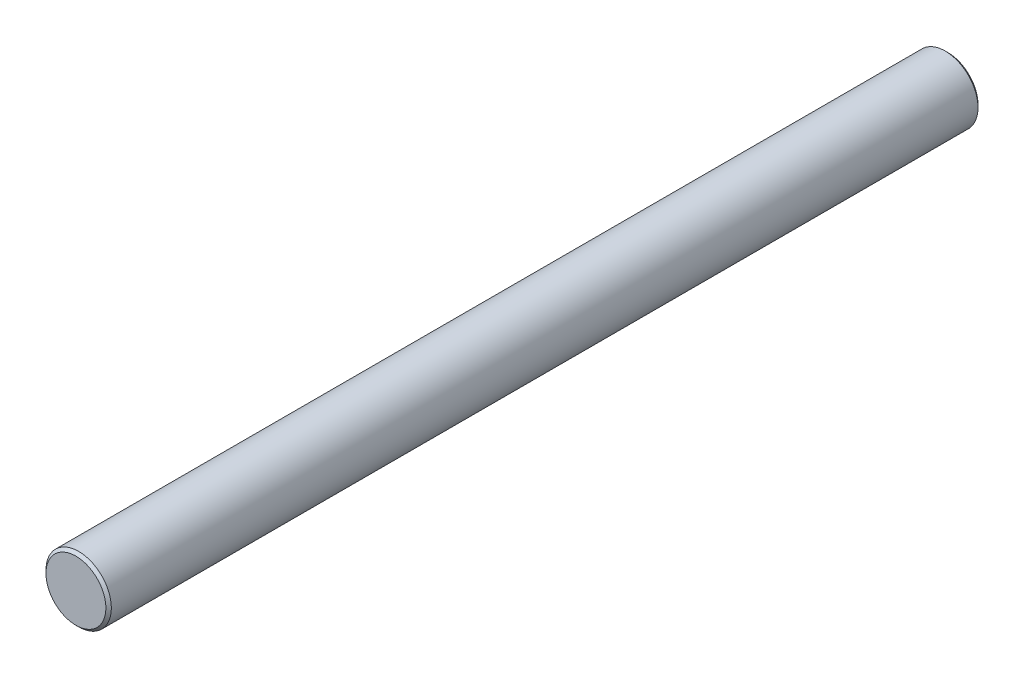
from build123d import *

# Parameters (mm, degrees)
SKETCH_1_R      = 3
EXTRUDE_1_DEPTH = 80
CHAMFER_1_SIZE  = 0.25


with BuildPart() as part:
    # Sketch 1 → Extrude 1 (new body)
    with BuildSketch(Plane.XY):
        Circle(SKETCH_1_R)
    extrude(amount=EXTRUDE_1_DEPTH)

    # Chamfer 1
    chamfer_1_edges = [part.edges().sort_by_distance(p)[0] for p in [
        (-3, 0, 0),
        (-3, 0, 80),
    ]]
    chamfer(chamfer_1_edges, length=CHAMFER_1_SIZE)


solid = part.part
